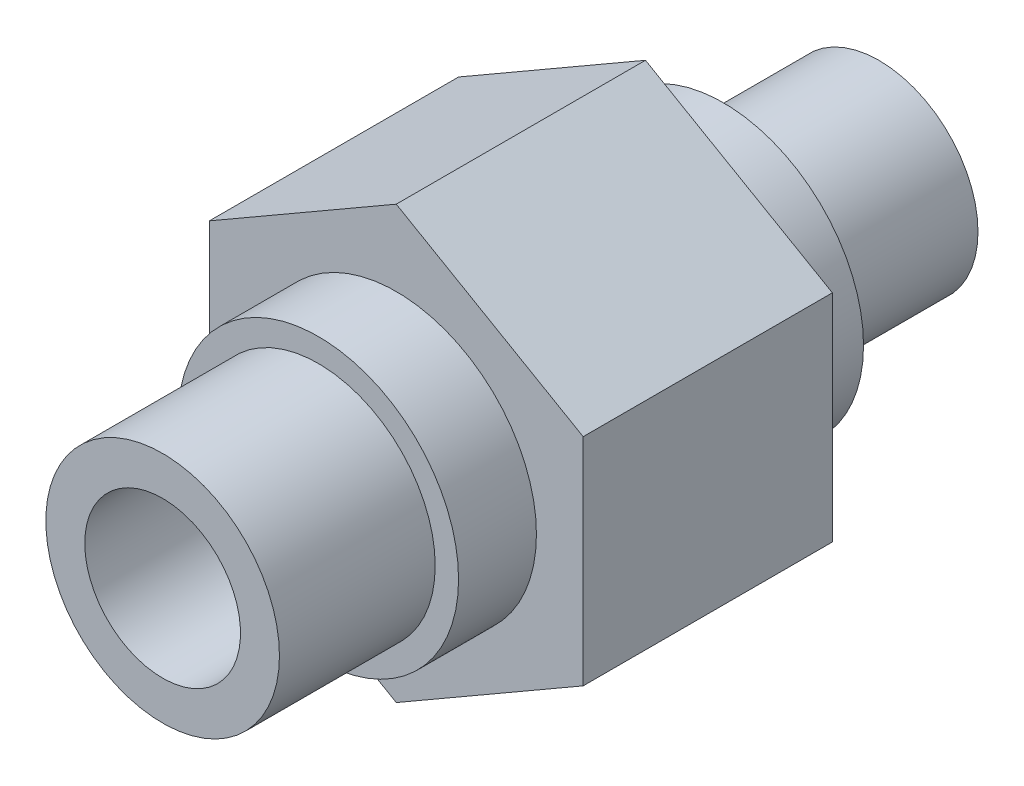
ISO-10303-21;
HEADER;
FILE_DESCRIPTION(('STEP AP214'),'2;1');
FILE_NAME('part.step','',(''),(''),'','','');
FILE_SCHEMA(('AUTOMOTIVE_DESIGN { 1 0 10303 214 1 1 1 1 }'));
ENDSEC;
DATA;
#1=APPLICATION_CONTEXT('core data for automotive mechanical design processes');
#2=APPLICATION_PROTOCOL_DEFINITION('international standard','automotive_design',2000,#1);
#3=PRODUCT_CONTEXT('',#1,'mechanical');
#4=PRODUCT('Part','Part','',(#3));
#5=PRODUCT_RELATED_PRODUCT_CATEGORY('part','',(#4));
#6=PRODUCT_DEFINITION_FORMATION('','',#4);
#7=PRODUCT_DEFINITION_CONTEXT('part definition',#1,'design');
#8=PRODUCT_DEFINITION('design','',#6,#7);
#9=PRODUCT_DEFINITION_SHAPE('','',#8);
#10=(LENGTH_UNIT() NAMED_UNIT(*) SI_UNIT(.MILLI.,.METRE.));
#11=(NAMED_UNIT(*) PLANE_ANGLE_UNIT() SI_UNIT($,.RADIAN.));
#12=(NAMED_UNIT(*) SI_UNIT($,.STERADIAN.) SOLID_ANGLE_UNIT());
#13=UNCERTAINTY_MEASURE_WITH_UNIT(LENGTH_MEASURE(1.E-05),#10,'distance_accuracy_value','');
#14=(GEOMETRIC_REPRESENTATION_CONTEXT(3) GLOBAL_UNCERTAINTY_ASSIGNED_CONTEXT((#13)) GLOBAL_UNIT_ASSIGNED_CONTEXT((#10,
#11,#12)) REPRESENTATION_CONTEXT('',''));
#15=CARTESIAN_POINT('',(0.,0.,0.));
#16=DIRECTION('',(0.,0.,1.));
#17=DIRECTION('',(1.,0.,0.));
#18=AXIS2_PLACEMENT_3D('',#15,#16,#17);
#19=CARTESIAN_POINT('',(0.,0.,-13.));
#20=DIRECTION('',(0.,0.,-1.));
#21=DIRECTION('',(-1.,0.,0.));
#22=AXIS2_PLACEMENT_3D('',#19,#20,#21);
#23=PLANE('',#22);
#24=CARTESIAN_POINT('',(0.,0.,-13.));
#25=DIRECTION('',(0.,0.,-1.));
#26=DIRECTION('',(-1.,0.,0.));
#27=AXIS2_PLACEMENT_3D('',#24,#25,#26);
#28=CIRCLE('',#27,9.);
#29=CARTESIAN_POINT('',(-9.,0.,-13.));
#30=VERTEX_POINT('',#29);
#31=EDGE_CURVE('E159',#30,#30,#28,.T.);
#32=ORIENTED_EDGE('',*,*,#31,.T.);
#33=EDGE_LOOP('',(#32));
#34=FACE_BOUND('',#33,.T.);
#35=CARTESIAN_POINT('',(0.,0.,-13.));
#36=DIRECTION('',(0.,0.,-1.));
#37=DIRECTION('',(-1.,0.,0.));
#38=AXIS2_PLACEMENT_3D('',#35,#36,#37);
#39=CIRCLE('',#38,6.35);
#40=CARTESIAN_POINT('',(-6.35,0.,-13.));
#41=VERTEX_POINT('',#40);
#42=EDGE_CURVE('E165',#41,#41,#39,.T.);
#43=ORIENTED_EDGE('',*,*,#42,.F.);
#44=EDGE_LOOP('',(#43));
#45=FACE_BOUND('',#44,.T.);
#46=ADVANCED_FACE('F32',(#34,#45),#23,.T.);
#47=CARTESIAN_POINT('',(0.,0.,-8.));
#48=DIRECTION('',(0.,0.,1.));
#49=DIRECTION('',(1.,0.,0.));
#50=AXIS2_PLACEMENT_3D('',#47,#48,#49);
#51=PLANE('',#50);
#52=DIRECTION('',(-0.866025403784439,0.5,0.));
#53=VECTOR('',#52,1.);
#54=CARTESIAN_POINT('',(12.,6.92820323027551,-8.));
#55=LINE('',#54,#53);
#56=CARTESIAN_POINT('',(12.,6.92820323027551,-8.));
#57=VERTEX_POINT('',#56);
#58=CARTESIAN_POINT('',(0.,13.856406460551,-8.));
#59=VERTEX_POINT('',#58);
#60=EDGE_CURVE('E119',#57,#59,#55,.T.);
#61=ORIENTED_EDGE('',*,*,#60,.F.);
#62=DIRECTION('',(0.,1.,0.));
#63=VECTOR('',#62,1.);
#64=CARTESIAN_POINT('',(12.,-6.92820323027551,-8.));
#65=LINE('',#64,#63);
#66=CARTESIAN_POINT('',(12.,-6.92820323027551,-8.));
#67=VERTEX_POINT('',#66);
#68=EDGE_CURVE('E78',#67,#57,#65,.T.);
#69=ORIENTED_EDGE('',*,*,#68,.F.);
#70=DIRECTION('',(0.866025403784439,0.5,0.));
#71=VECTOR('',#70,1.);
#72=CARTESIAN_POINT('',(0.,-13.856406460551,-8.));
#73=LINE('',#72,#71);
#74=CARTESIAN_POINT('',(0.,-13.856406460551,-8.));
#75=VERTEX_POINT('',#74);
#76=EDGE_CURVE('E72',#75,#67,#73,.T.);
#77=ORIENTED_EDGE('',*,*,#76,.F.);
#78=DIRECTION('',(0.866025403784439,-0.5,0.));
#79=VECTOR('',#78,1.);
#80=CARTESIAN_POINT('',(-12.,-6.92820323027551,-8.));
#81=LINE('',#80,#79);
#82=CARTESIAN_POINT('',(-12.,-6.92820323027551,-8.));
#83=VERTEX_POINT('',#82);
#84=EDGE_CURVE('E109',#83,#75,#81,.T.);
#85=ORIENTED_EDGE('',*,*,#84,.F.);
#86=DIRECTION('',(0.,-1.,0.));
#87=VECTOR('',#86,1.);
#88=CARTESIAN_POINT('',(-12.,6.92820323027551,-8.));
#89=LINE('',#88,#87);
#90=CARTESIAN_POINT('',(-12.,6.92820323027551,-8.));
#91=VERTEX_POINT('',#90);
#92=EDGE_CURVE('E125',#91,#83,#89,.T.);
#93=ORIENTED_EDGE('',*,*,#92,.F.);
#94=DIRECTION('',(-0.866025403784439,-0.5,0.));
#95=VECTOR('',#94,1.);
#96=CARTESIAN_POINT('',(0.,13.856406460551,-8.));
#97=LINE('',#96,#95);
#98=EDGE_CURVE('E122',#59,#91,#97,.T.);
#99=ORIENTED_EDGE('',*,*,#98,.F.);
#100=EDGE_LOOP('',(#61,#69,#77,#85,#93,#99));
#101=FACE_BOUND('',#100,.T.);
#102=CARTESIAN_POINT('',(0.,0.,-8.));
#103=DIRECTION('',(0.,0.,1.));
#104=DIRECTION('',(1.,0.,0.));
#105=AXIS2_PLACEMENT_3D('',#102,#103,#104);
#106=CIRCLE('',#105,9.);
#107=CARTESIAN_POINT('',(9.,0.,-8.));
#108=VERTEX_POINT('',#107);
#109=EDGE_CURVE('E11',#108,#108,#106,.F.);
#110=ORIENTED_EDGE('',*,*,#109,.F.);
#111=EDGE_LOOP('',(#110));
#112=FACE_BOUND('',#111,.T.);
#113=ADVANCED_FACE('F142',(#101,#112),#51,.F.);
#114=CARTESIAN_POINT('',(0.,0.,13.));
#115=DIRECTION('',(0.,0.,1.));
#116=DIRECTION('',(1.,0.,0.));
#117=AXIS2_PLACEMENT_3D('',#114,#115,#116);
#118=PLANE('',#117);
#119=CARTESIAN_POINT('',(0.,0.,13.));
#120=DIRECTION('',(0.,0.,1.));
#121=DIRECTION('',(1.,0.,0.));
#122=AXIS2_PLACEMENT_3D('',#119,#120,#121);
#123=CIRCLE('',#122,9.);
#124=CARTESIAN_POINT('',(9.,0.,13.));
#125=VERTEX_POINT('',#124);
#126=EDGE_CURVE('E123',#125,#125,#123,.T.);
#127=ORIENTED_EDGE('',*,*,#126,.T.);
#128=EDGE_LOOP('',(#127));
#129=FACE_BOUND('',#128,.T.);
#130=CARTESIAN_POINT('',(0.,0.,13.));
#131=DIRECTION('',(0.,0.,1.));
#132=DIRECTION('',(1.,0.,0.));
#133=AXIS2_PLACEMENT_3D('',#130,#131,#132);
#134=CIRCLE('',#133,7.5);
#135=CARTESIAN_POINT('',(7.5,0.,13.));
#136=VERTEX_POINT('',#135);
#137=EDGE_CURVE('E156',#136,#136,#134,.T.);
#138=ORIENTED_EDGE('',*,*,#137,.F.);
#139=EDGE_LOOP('',(#138));
#140=FACE_BOUND('',#139,.T.);
#141=ADVANCED_FACE('F205',(#129,#140),#118,.T.);
#142=CARTESIAN_POINT('',(0.,0.,8.));
#143=DIRECTION('',(0.,0.,1.));
#144=DIRECTION('',(1.,0.,0.));
#145=AXIS2_PLACEMENT_3D('',#142,#143,#144);
#146=PLANE('',#145);
#147=DIRECTION('',(-0.866025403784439,0.5,0.));
#148=VECTOR('',#147,1.);
#149=CARTESIAN_POINT('',(12.,6.92820323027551,8.));
#150=LINE('',#149,#148);
#151=CARTESIAN_POINT('',(12.,6.92820323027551,8.));
#152=VERTEX_POINT('',#151);
#153=CARTESIAN_POINT('',(0.,13.856406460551,8.));
#154=VERTEX_POINT('',#153);
#155=EDGE_CURVE('E130',#152,#154,#150,.T.);
#156=ORIENTED_EDGE('',*,*,#155,.T.);
#157=DIRECTION('',(-0.866025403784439,-0.5,0.));
#158=VECTOR('',#157,1.);
#159=CARTESIAN_POINT('',(0.,13.856406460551,8.));
#160=LINE('',#159,#158);
#161=CARTESIAN_POINT('',(-12.,6.92820323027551,8.));
#162=VERTEX_POINT('',#161);
#163=EDGE_CURVE('E87',#154,#162,#160,.T.);
#164=ORIENTED_EDGE('',*,*,#163,.T.);
#165=DIRECTION('',(0.,-1.,0.));
#166=VECTOR('',#165,1.);
#167=CARTESIAN_POINT('',(-12.,6.92820323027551,8.));
#168=LINE('',#167,#166);
#169=CARTESIAN_POINT('',(-12.,-6.92820323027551,8.));
#170=VERTEX_POINT('',#169);
#171=EDGE_CURVE('E101',#162,#170,#168,.T.);
#172=ORIENTED_EDGE('',*,*,#171,.T.);
#173=DIRECTION('',(0.866025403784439,-0.5,0.));
#174=VECTOR('',#173,1.);
#175=CARTESIAN_POINT('',(-12.,-6.92820323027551,8.));
#176=LINE('',#175,#174);
#177=CARTESIAN_POINT('',(0.,-13.856406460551,8.));
#178=VERTEX_POINT('',#177);
#179=EDGE_CURVE('E94',#170,#178,#176,.T.);
#180=ORIENTED_EDGE('',*,*,#179,.T.);
#181=DIRECTION('',(0.866025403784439,0.5,0.));
#182=VECTOR('',#181,1.);
#183=CARTESIAN_POINT('',(0.,-13.856406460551,8.));
#184=LINE('',#183,#182);
#185=CARTESIAN_POINT('',(12.,-6.92820323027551,8.));
#186=VERTEX_POINT('',#185);
#187=EDGE_CURVE('E99',#178,#186,#184,.T.);
#188=ORIENTED_EDGE('',*,*,#187,.T.);
#189=DIRECTION('',(0.,1.,0.));
#190=VECTOR('',#189,1.);
#191=CARTESIAN_POINT('',(12.,-6.92820323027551,8.));
#192=LINE('',#191,#190);
#193=EDGE_CURVE('E49',#186,#152,#192,.T.);
#194=ORIENTED_EDGE('',*,*,#193,.T.);
#195=EDGE_LOOP('',(#156,#164,#172,#180,#188,#194));
#196=FACE_BOUND('',#195,.T.);
#197=CARTESIAN_POINT('',(0.,0.,8.));
#198=DIRECTION('',(0.,0.,1.));
#199=DIRECTION('',(1.,0.,0.));
#200=AXIS2_PLACEMENT_3D('',#197,#198,#199);
#201=CIRCLE('',#200,9.);
#202=CARTESIAN_POINT('',(9.,0.,8.));
#203=VERTEX_POINT('',#202);
#204=EDGE_CURVE('E150',#203,#203,#201,.T.);
#205=ORIENTED_EDGE('',*,*,#204,.F.);
#206=EDGE_LOOP('',(#205));
#207=FACE_BOUND('',#206,.T.);
#208=ADVANCED_FACE('F96',(#196,#207),#146,.T.);
#209=CARTESIAN_POINT('',(12.,6.92820323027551,8.));
#210=DIRECTION('',(-0.5,-0.866025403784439,0.));
#211=DIRECTION('',(0.866025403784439,-0.5,0.));
#212=AXIS2_PLACEMENT_3D('',#209,#210,#211);
#213=PLANE('',#212);
#214=ORIENTED_EDGE('',*,*,#60,.T.);
#215=DIRECTION('',(0.,0.,-1.));
#216=VECTOR('',#215,1.);
#217=CARTESIAN_POINT('',(0.,13.856406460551,8.));
#218=LINE('',#217,#216);
#219=EDGE_CURVE('E41',#154,#59,#218,.T.);
#220=ORIENTED_EDGE('',*,*,#219,.F.);
#221=ORIENTED_EDGE('',*,*,#155,.F.);
#222=DIRECTION('',(0.,0.,-1.));
#223=VECTOR('',#222,1.);
#224=CARTESIAN_POINT('',(12.,6.92820323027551,8.));
#225=LINE('',#224,#223);
#226=EDGE_CURVE('E115',#152,#57,#225,.T.);
#227=ORIENTED_EDGE('',*,*,#226,.T.);
#228=EDGE_LOOP('',(#214,#220,#221,#227));
#229=FACE_BOUND('',#228,.T.);
#230=ADVANCED_FACE('F34',(#229),#213,.F.);
#231=CARTESIAN_POINT('',(0.,13.856406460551,8.));
#232=DIRECTION('',(0.5,-0.866025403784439,0.));
#233=DIRECTION('',(0.866025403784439,0.5,0.));
#234=AXIS2_PLACEMENT_3D('',#231,#232,#233);
#235=PLANE('',#234);
#236=ORIENTED_EDGE('',*,*,#98,.T.);
#237=DIRECTION('',(0.,0.,-1.));
#238=VECTOR('',#237,1.);
#239=CARTESIAN_POINT('',(-12.,6.92820323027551,8.));
#240=LINE('',#239,#238);
#241=EDGE_CURVE('E134',#162,#91,#240,.T.);
#242=ORIENTED_EDGE('',*,*,#241,.F.);
#243=ORIENTED_EDGE('',*,*,#163,.F.);
#244=ORIENTED_EDGE('',*,*,#219,.T.);
#245=EDGE_LOOP('',(#236,#242,#243,#244));
#246=FACE_BOUND('',#245,.T.);
#247=ADVANCED_FACE('F137',(#246),#235,.F.);
#248=CARTESIAN_POINT('',(-12.,6.92820323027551,8.));
#249=DIRECTION('',(1.,0.,0.));
#250=DIRECTION('',(0.,1.,0.));
#251=AXIS2_PLACEMENT_3D('',#248,#249,#250);
#252=PLANE('',#251);
#253=ORIENTED_EDGE('',*,*,#92,.T.);
#254=DIRECTION('',(0.,0.,-1.));
#255=VECTOR('',#254,1.);
#256=CARTESIAN_POINT('',(-12.,-6.92820323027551,8.));
#257=LINE('',#256,#255);
#258=EDGE_CURVE('E110',#170,#83,#257,.T.);
#259=ORIENTED_EDGE('',*,*,#258,.F.);
#260=ORIENTED_EDGE('',*,*,#171,.F.);
#261=ORIENTED_EDGE('',*,*,#241,.T.);
#262=EDGE_LOOP('',(#253,#259,#260,#261));
#263=FACE_BOUND('',#262,.T.);
#264=ADVANCED_FACE('F146',(#263),#252,.F.);
#265=CARTESIAN_POINT('',(-12.,-6.92820323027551,8.));
#266=DIRECTION('',(0.5,0.866025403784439,0.));
#267=DIRECTION('',(-0.866025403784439,0.5,0.));
#268=AXIS2_PLACEMENT_3D('',#265,#266,#267);
#269=PLANE('',#268);
#270=ORIENTED_EDGE('',*,*,#84,.T.);
#271=DIRECTION('',(0.,0.,-1.));
#272=VECTOR('',#271,1.);
#273=CARTESIAN_POINT('',(0.,-13.856406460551,8.));
#274=LINE('',#273,#272);
#275=EDGE_CURVE('E106',#178,#75,#274,.T.);
#276=ORIENTED_EDGE('',*,*,#275,.F.);
#277=ORIENTED_EDGE('',*,*,#179,.F.);
#278=ORIENTED_EDGE('',*,*,#258,.T.);
#279=EDGE_LOOP('',(#270,#276,#277,#278));
#280=FACE_BOUND('',#279,.T.);
#281=ADVANCED_FACE('F107',(#280),#269,.F.);
#282=CARTESIAN_POINT('',(0.,-13.856406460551,8.));
#283=DIRECTION('',(-0.5,0.866025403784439,0.));
#284=DIRECTION('',(-0.866025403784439,-0.5,0.));
#285=AXIS2_PLACEMENT_3D('',#282,#283,#284);
#286=PLANE('',#285);
#287=ORIENTED_EDGE('',*,*,#76,.T.);
#288=DIRECTION('',(0.,0.,-1.));
#289=VECTOR('',#288,1.);
#290=CARTESIAN_POINT('',(12.,-6.92820323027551,8.));
#291=LINE('',#290,#289);
#292=EDGE_CURVE('E111',#186,#67,#291,.T.);
#293=ORIENTED_EDGE('',*,*,#292,.F.);
#294=ORIENTED_EDGE('',*,*,#187,.F.);
#295=ORIENTED_EDGE('',*,*,#275,.T.);
#296=EDGE_LOOP('',(#287,#293,#294,#295));
#297=FACE_BOUND('',#296,.T.);
#298=ADVANCED_FACE('F113',(#297),#286,.F.);
#299=CARTESIAN_POINT('',(12.,-6.92820323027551,8.));
#300=DIRECTION('',(-1.,0.,0.));
#301=DIRECTION('',(0.,0.,1.));
#302=AXIS2_PLACEMENT_3D('',#299,#300,#301);
#303=PLANE('',#302);
#304=ORIENTED_EDGE('',*,*,#68,.T.);
#305=ORIENTED_EDGE('',*,*,#226,.F.);
#306=ORIENTED_EDGE('',*,*,#193,.F.);
#307=ORIENTED_EDGE('',*,*,#292,.T.);
#308=EDGE_LOOP('',(#304,#305,#306,#307));
#309=FACE_BOUND('',#308,.T.);
#310=ADVANCED_FACE('F223',(#309),#303,.F.);
#311=CARTESIAN_POINT('',(0.,0.,13.));
#312=DIRECTION('',(0.,0.,-1.));
#313=DIRECTION('',(-1.,0.,0.));
#314=AXIS2_PLACEMENT_3D('',#311,#312,#313);
#315=CYLINDRICAL_SURFACE('',#314,9.);
#316=ORIENTED_EDGE('',*,*,#126,.F.);
#317=EDGE_LOOP('',(#316));
#318=FACE_BOUND('',#317,.T.);
#319=ORIENTED_EDGE('',*,*,#204,.T.);
#320=EDGE_LOOP('',(#319));
#321=FACE_BOUND('',#320,.T.);
#322=ADVANCED_FACE('F216',(#318,#321),#315,.T.);
#323=CARTESIAN_POINT('',(0.,0.,23.));
#324=DIRECTION('',(0.,0.,-1.));
#325=DIRECTION('',(-1.,0.,0.));
#326=AXIS2_PLACEMENT_3D('',#323,#324,#325);
#327=CYLINDRICAL_SURFACE('',#326,7.5);
#328=CARTESIAN_POINT('',(0.,0.,23.));
#329=DIRECTION('',(0.,0.,1.));
#330=DIRECTION('',(1.,0.,0.));
#331=AXIS2_PLACEMENT_3D('',#328,#329,#330);
#332=CIRCLE('',#331,7.5);
#333=CARTESIAN_POINT('',(7.5,0.,23.));
#334=VERTEX_POINT('',#333);
#335=EDGE_CURVE('E153',#334,#334,#332,.T.);
#336=ORIENTED_EDGE('',*,*,#335,.F.);
#337=EDGE_LOOP('',(#336));
#338=FACE_BOUND('',#337,.T.);
#339=ORIENTED_EDGE('',*,*,#137,.T.);
#340=EDGE_LOOP('',(#339));
#341=FACE_BOUND('',#340,.T.);
#342=ADVANCED_FACE('F213',(#338,#341),#327,.T.);
#343=CARTESIAN_POINT('',(0.,0.,23.));
#344=DIRECTION('',(0.,0.,1.));
#345=DIRECTION('',(1.,0.,0.));
#346=AXIS2_PLACEMENT_3D('',#343,#344,#345);
#347=PLANE('',#346);
#348=CARTESIAN_POINT('',(0.,0.,23.));
#349=DIRECTION('',(0.,0.,-1.));
#350=DIRECTION('',(-1.,0.,0.));
#351=AXIS2_PLACEMENT_3D('',#348,#349,#350);
#352=CIRCLE('',#351,5.);
#353=CARTESIAN_POINT('',(-5.,0.,23.));
#354=VERTEX_POINT('',#353);
#355=EDGE_CURVE('E168',#354,#354,#352,.T.);
#356=ORIENTED_EDGE('',*,*,#355,.T.);
#357=EDGE_LOOP('',(#356));
#358=FACE_BOUND('',#357,.T.);
#359=ORIENTED_EDGE('',*,*,#335,.T.);
#360=EDGE_LOOP('',(#359));
#361=FACE_BOUND('',#360,.T.);
#362=ADVANCED_FACE('F177',(#358,#361),#347,.T.);
#363=CARTESIAN_POINT('',(0.,0.,-13.));
#364=DIRECTION('',(0.,0.,1.));
#365=DIRECTION('',(1.,0.,0.));
#366=AXIS2_PLACEMENT_3D('',#363,#364,#365);
#367=CYLINDRICAL_SURFACE('',#366,9.);
#368=ORIENTED_EDGE('',*,*,#31,.F.);
#369=EDGE_LOOP('',(#368));
#370=FACE_BOUND('',#369,.T.);
#371=ORIENTED_EDGE('',*,*,#109,.T.);
#372=EDGE_LOOP('',(#371));
#373=FACE_BOUND('',#372,.T.);
#374=ADVANCED_FACE('F195',(#370,#373),#367,.T.);
#375=CARTESIAN_POINT('',(0.,0.,-23.));
#376=DIRECTION('',(0.,0.,1.));
#377=DIRECTION('',(1.,0.,0.));
#378=AXIS2_PLACEMENT_3D('',#375,#376,#377);
#379=CYLINDRICAL_SURFACE('',#378,6.35);
#380=CARTESIAN_POINT('',(0.,0.,-23.));
#381=DIRECTION('',(0.,0.,-1.));
#382=DIRECTION('',(-1.,0.,0.));
#383=AXIS2_PLACEMENT_3D('',#380,#381,#382);
#384=CIRCLE('',#383,6.35);
#385=CARTESIAN_POINT('',(-6.35,0.,-23.));
#386=VERTEX_POINT('',#385);
#387=EDGE_CURVE('E164',#386,#386,#384,.T.);
#388=ORIENTED_EDGE('',*,*,#387,.F.);
#389=EDGE_LOOP('',(#388));
#390=FACE_BOUND('',#389,.T.);
#391=ORIENTED_EDGE('',*,*,#42,.T.);
#392=EDGE_LOOP('',(#391));
#393=FACE_BOUND('',#392,.T.);
#394=ADVANCED_FACE('F189',(#390,#393),#379,.T.);
#395=CARTESIAN_POINT('',(0.,0.,-23.));
#396=DIRECTION('',(0.,0.,-1.));
#397=DIRECTION('',(-1.,0.,0.));
#398=AXIS2_PLACEMENT_3D('',#395,#396,#397);
#399=PLANE('',#398);
#400=CARTESIAN_POINT('',(0.,0.,-23.));
#401=DIRECTION('',(0.,0.,-1.));
#402=DIRECTION('',(-1.,0.,0.));
#403=AXIS2_PLACEMENT_3D('',#400,#401,#402);
#404=CIRCLE('',#403,5.);
#405=CARTESIAN_POINT('',(-5.,0.,-23.));
#406=VERTEX_POINT('',#405);
#407=EDGE_CURVE('E171',#406,#406,#404,.T.);
#408=ORIENTED_EDGE('',*,*,#407,.F.);
#409=EDGE_LOOP('',(#408));
#410=FACE_BOUND('',#409,.T.);
#411=ORIENTED_EDGE('',*,*,#387,.T.);
#412=EDGE_LOOP('',(#411));
#413=FACE_BOUND('',#412,.T.);
#414=ADVANCED_FACE('F183',(#410,#413),#399,.T.);
#415=CARTESIAN_POINT('',(0.,0.,23.));
#416=DIRECTION('',(0.,0.,-1.));
#417=DIRECTION('',(-1.,0.,0.));
#418=AXIS2_PLACEMENT_3D('',#415,#416,#417);
#419=CYLINDRICAL_SURFACE('',#418,5.);
#420=ORIENTED_EDGE('',*,*,#355,.F.);
#421=EDGE_LOOP('',(#420));
#422=FACE_BOUND('',#421,.T.);
#423=ORIENTED_EDGE('',*,*,#407,.T.);
#424=EDGE_LOOP('',(#423));
#425=FACE_BOUND('',#424,.T.);
#426=ADVANCED_FACE('F180',(#422,#425),#419,.F.);
#427=CLOSED_SHELL('',(#46,#113,#141,#208,#230,#247,#264,#281,#298,#310,#322,#342,#362,#374,#394,
#414,#426));
#428=MANIFOLD_SOLID_BREP('B2',#427);
#429=ADVANCED_BREP_SHAPE_REPRESENTATION('',(#18,#428),#14);
#430=SHAPE_DEFINITION_REPRESENTATION(#9,#429);
ENDSEC;
END-ISO-10303-21;
